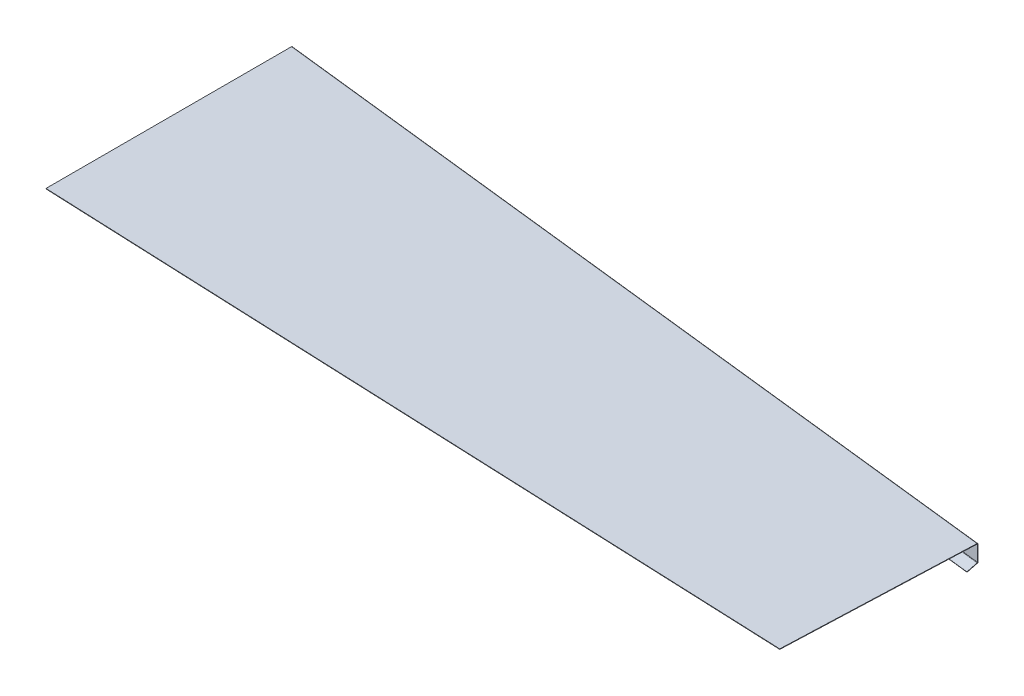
ISO-10303-21;
HEADER;
FILE_DESCRIPTION(('STEP AP214'),'2;1');
FILE_NAME('part.step','',(''),(''),'','','');
FILE_SCHEMA(('AUTOMOTIVE_DESIGN { 1 0 10303 214 1 1 1 1 }'));
ENDSEC;
DATA;
#1=APPLICATION_CONTEXT('core data for automotive mechanical design processes');
#2=APPLICATION_PROTOCOL_DEFINITION('international standard','automotive_design',2000,#1);
#3=PRODUCT_CONTEXT('',#1,'mechanical');
#4=PRODUCT('Part','Part','',(#3));
#5=PRODUCT_RELATED_PRODUCT_CATEGORY('part','',(#4));
#6=PRODUCT_DEFINITION_FORMATION('','',#4);
#7=PRODUCT_DEFINITION_CONTEXT('part definition',#1,'design');
#8=PRODUCT_DEFINITION('design','',#6,#7);
#9=PRODUCT_DEFINITION_SHAPE('','',#8);
#10=(LENGTH_UNIT() NAMED_UNIT(*) SI_UNIT(.MILLI.,.METRE.));
#11=(NAMED_UNIT(*) PLANE_ANGLE_UNIT() SI_UNIT($,.RADIAN.));
#12=(NAMED_UNIT(*) SI_UNIT($,.STERADIAN.) SOLID_ANGLE_UNIT());
#13=UNCERTAINTY_MEASURE_WITH_UNIT(LENGTH_MEASURE(1.E-05),#10,'distance_accuracy_value','');
#14=(GEOMETRIC_REPRESENTATION_CONTEXT(3) GLOBAL_UNCERTAINTY_ASSIGNED_CONTEXT((#13)) GLOBAL_UNIT_ASSIGNED_CONTEXT((#10,
#11,#12)) REPRESENTATION_CONTEXT('',''));
#15=CARTESIAN_POINT('',(0.,0.,0.));
#16=DIRECTION('',(0.,0.,1.));
#17=DIRECTION('',(1.,0.,0.));
#18=AXIS2_PLACEMENT_3D('',#15,#16,#17);
#19=CARTESIAN_POINT('',(119.2183013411,0.,-1155.85593612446));
#20=DIRECTION('',(0.993648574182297,0.,0.11252782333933));
#21=DIRECTION('',(0.,-1.,0.));
#22=AXIS2_PLACEMENT_3D('',#19,#20,#21);
#23=PLANE('',#22);
#24=DIRECTION('',(-0.11252782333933,0.,0.993648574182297));
#25=VECTOR('',#24,1.);
#26=CARTESIAN_POINT('',(119.2183013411,-54.7487291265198,-1155.85593612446));
#27=LINE('',#26,#25);
#28=CARTESIAN_POINT('',(119.40122657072,-54.7487291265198,-1157.47121124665));
#29=VERTEX_POINT('',#28);
#30=CARTESIAN_POINT('',(119.2183013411,-54.7487291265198,-1155.85593612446));
#31=VERTEX_POINT('',#30);
#32=EDGE_CURVE('E12',#29,#31,#27,.T.);
#33=ORIENTED_EDGE('',*,*,#32,.F.);
#34=DIRECTION('',(0.,1.,0.));
#35=VECTOR('',#34,1.);
#36=CARTESIAN_POINT('',(119.40122657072,0.,-1157.47121124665));
#37=LINE('',#36,#35);
#38=CARTESIAN_POINT('',(119.40122657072,-1.62560000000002,-1157.47121124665));
#39=VERTEX_POINT('',#38);
#40=EDGE_CURVE('E210',#39,#29,#37,.F.);
#41=ORIENTED_EDGE('',*,*,#40,.F.);
#42=DIRECTION('',(-0.11252782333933,0.,0.993648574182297));
#43=VECTOR('',#42,1.);
#44=CARTESIAN_POINT('',(119.2183013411,-1.62560000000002,-1155.85593612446));
#45=LINE('',#44,#43);
#46=CARTESIAN_POINT('',(119.2183013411,-1.62560000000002,-1155.85593612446));
#47=VERTEX_POINT('',#46);
#48=EDGE_CURVE('E158',#39,#47,#45,.T.);
#49=ORIENTED_EDGE('',*,*,#48,.T.);
#50=DIRECTION('',(0.,-1.,0.));
#51=VECTOR('',#50,1.);
#52=CARTESIAN_POINT('',(119.2183013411,0.,-1155.85593612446));
#53=LINE('',#52,#51);
#54=EDGE_CURVE('E213',#47,#31,#53,.T.);
#55=ORIENTED_EDGE('',*,*,#54,.T.);
#56=EDGE_LOOP('',(#33,#41,#49,#55));
#57=FACE_BOUND('',#56,.T.);
#58=ADVANCED_FACE('F145',(#57),#23,.T.);
#59=CARTESIAN_POINT('',(118.90753993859,-1.62560000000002,-1150.98315632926));
#60=CARTESIAN_POINT('',(118.96851501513,-1.62560000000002,-1151.52158136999));
#61=CARTESIAN_POINT('',(119.029490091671,-1.62560000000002,-1152.06000641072));
#62=CARTESIAN_POINT('',(119.090465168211,-1.62560000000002,-1152.59843145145));
#63=CARTESIAN_POINT('',(118.90753993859,-8.12800000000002,-1150.98315632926));
#64=CARTESIAN_POINT('',(118.96851501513,-7.04426666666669,-1151.52158136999));
#65=CARTESIAN_POINT('',(119.029490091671,-5.96053333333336,-1152.06000641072));
#66=CARTESIAN_POINT('',(119.090465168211,-4.87680000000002,-1152.59843145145));
#67=CARTESIAN_POINT('',(119.40122657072,-8.12800000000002,-1157.47121124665));
#68=CARTESIAN_POINT('',(119.34025149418,-7.04426666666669,-1156.93278620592));
#69=CARTESIAN_POINT('',(119.27927641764,-5.96053333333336,-1156.39436116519));
#70=CARTESIAN_POINT('',(119.2183013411,-4.87680000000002,-1155.85593612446));
#71=CARTESIAN_POINT('',(119.40122657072,-1.62560000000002,-1157.47121124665));
#72=CARTESIAN_POINT('',(119.34025149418,-1.62560000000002,-1156.93278620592));
#73=CARTESIAN_POINT('',(119.27927641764,-1.62560000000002,-1156.39436116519));
#74=CARTESIAN_POINT('',(119.2183013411,-1.62560000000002,-1155.85593612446));
#75=CARTESIAN_POINT('',(119.40122657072,4.87679999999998,-1157.47121124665));
#76=CARTESIAN_POINT('',(119.34025149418,3.79306666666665,-1156.93278620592));
#77=CARTESIAN_POINT('',(119.27927641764,2.70933333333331,-1156.39436116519));
#78=CARTESIAN_POINT('',(119.2183013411,1.62559999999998,-1155.85593612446));
#79=CARTESIAN_POINT('',(118.90753993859,4.87679999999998,-1150.98315632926));
#80=CARTESIAN_POINT('',(118.96851501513,3.79306666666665,-1151.52158136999));
#81=CARTESIAN_POINT('',(119.029490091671,2.70933333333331,-1152.06000641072));
#82=CARTESIAN_POINT('',(119.090465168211,1.62559999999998,-1152.59843145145));
#83=CARTESIAN_POINT('',(118.90753993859,-1.62560000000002,-1150.98315632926));
#84=CARTESIAN_POINT('',(118.96851501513,-1.62560000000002,-1151.52158136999));
#85=CARTESIAN_POINT('',(119.029490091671,-1.62560000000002,-1152.06000641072));
#86=CARTESIAN_POINT('',(119.090465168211,-1.62560000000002,-1152.59843145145));
#87=(BOUNDED_SURFACE() B_SPLINE_SURFACE(3,3,((#59,#60,#61,#62),(#63,#64,#65,#66),(#67,#68,#69,
#70),(#71,#72,#73,#74),(#75,#76,#77,#78),(#79,#80,#81,#82),(#83,#84,#85,#86)),.UNSPECIFIED.,.T.,
.F.,.F.) B_SPLINE_SURFACE_WITH_KNOTS((4,3,4),(4,4),(0.,0.5,1.),(0.,1.),
.UNSPECIFIED.) GEOMETRIC_REPRESENTATION_ITEM() RATIONAL_B_SPLINE_SURFACE(((1.,1.,1.,1.),
(0.333333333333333,0.333333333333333,0.333333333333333,0.333333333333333),(0.333333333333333,
0.333333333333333,0.333333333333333,0.333333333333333),(1.,1.,1.,1.),(0.333333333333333,
0.333333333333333,0.333333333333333,0.333333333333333),(0.333333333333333,0.333333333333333,
0.333333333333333,0.333333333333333),(1.,1.,1.,1.))) REPRESENTATION_ITEM('') SURFACE());
#88=CARTESIAN_POINT('',(119.154383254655,-1.62560000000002,-1154.22718378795));
#89=DIRECTION('',(-0.997117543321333,0.,-0.0758722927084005));
#90=DIRECTION('',(-0.0758722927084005,0.,0.997117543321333));
#91=AXIS2_PLACEMENT_3D('',#88,#89,#90);
#92=ELLIPSE('',#91,3.25340525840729,3.2512);
#93=CARTESIAN_POINT('',(119.154383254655,1.62559999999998,-1154.22718378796));
#94=VERTEX_POINT('',#93);
#95=EDGE_CURVE('E249',#39,#94,#92,.F.);
#96=DIRECTION('',(0.,-1.,0.));
#97=VECTOR('',#96,1.);
#98=CARTESIAN_POINT('',(119.154383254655,0.,-1154.22718378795));
#99=LINE('',#98,#97);
#100=CARTESIAN_POINT('',(119.154383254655,0.,-1154.22718378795));
#101=VERTEX_POINT('',#100);
#102=EDGE_CURVE('E288',#94,#101,#99,.T.);
#103=CARTESIAN_POINT('',(119.154383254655,-1.62560000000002,-1154.22718378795));
#104=DIRECTION('',(-0.999230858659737,0.,-0.0392134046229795));
#105=DIRECTION('',(-0.0392134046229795,0.,0.999230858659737));
#106=AXIS2_PLACEMENT_3D('',#103,#104,#105);
#107=ELLIPSE('',#106,1.6300060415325,1.6256);
#108=EDGE_CURVE('E308',#47,#101,#107,.F.);
#109=ORIENTED_EDGE('',*,*,#48,.F.);
#110=ORIENTED_EDGE('',*,*,#95,.T.);
#111=ORIENTED_EDGE('',*,*,#102,.T.);
#112=ORIENTED_EDGE('',*,*,#108,.F.);
#113=EDGE_LOOP('',(#109,#110,#111,#112));
#114=FACE_BOUND('',#113,.T.);
#115=ADVANCED_FACE('F309',(#114),#87,.T.);
#116=CARTESIAN_POINT('',(73.7447952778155,0.,2.89401039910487));
#117=DIRECTION('',(0.999230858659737,0.,0.0392134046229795));
#118=DIRECTION('',(0.0392134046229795,0.,-0.999230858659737));
#119=AXIS2_PLACEMENT_3D('',#116,#117,#118);
#120=PLANE('',#119);
#121=ORIENTED_EDGE('',*,*,#102,.F.);
#122=DIRECTION('',(0.0392134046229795,0.,-0.999230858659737));
#123=VECTOR('',#122,1.);
#124=CARTESIAN_POINT('',(73.7447952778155,1.62559999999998,2.89401039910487));
#125=LINE('',#124,#123);
#126=CARTESIAN_POINT('',(93.4092633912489,1.62559999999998,-498.193399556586));
#127=VERTEX_POINT('',#126);
#128=EDGE_CURVE('E357',#127,#94,#125,.T.);
#129=ORIENTED_EDGE('',*,*,#128,.F.);
#130=DIRECTION('',(0.,-1.,0.));
#131=VECTOR('',#130,1.);
#132=CARTESIAN_POINT('',(93.4092633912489,0.,-498.193399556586));
#133=LINE('',#132,#131);
#134=CARTESIAN_POINT('',(93.4092633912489,0.,-498.193399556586));
#135=VERTEX_POINT('',#134);
#136=EDGE_CURVE('E284',#127,#135,#133,.T.);
#137=ORIENTED_EDGE('',*,*,#136,.T.);
#138=DIRECTION('',(0.0392134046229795,0.,-0.999230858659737));
#139=VECTOR('',#138,1.);
#140=CARTESIAN_POINT('',(73.7447952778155,0.,2.89401039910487));
#141=LINE('',#140,#139);
#142=EDGE_CURVE('E389',#135,#101,#141,.T.);
#143=ORIENTED_EDGE('',*,*,#142,.T.);
#144=EDGE_LOOP('',(#121,#129,#137,#143));
#145=FACE_BOUND('',#144,.T.);
#146=ADVANCED_FACE('F388',(#145),#120,.T.);
#147=CARTESIAN_POINT('',(-2578.1,0.,-609.585406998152));
#148=DIRECTION('',(-0.041660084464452,0.,0.999131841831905));
#149=DIRECTION('',(0.999131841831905,0.,0.041660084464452));
#150=AXIS2_PLACEMENT_3D('',#147,#148,#149);
#151=PLANE('',#150);
#152=ORIENTED_EDGE('',*,*,#136,.F.);
#153=DIRECTION('',(0.999131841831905,0.,0.041660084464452));
#154=VECTOR('',#153,1.);
#155=CARTESIAN_POINT('',(-2578.1,1.62559999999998,-609.585406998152));
#156=LINE('',#155,#154);
#157=CARTESIAN_POINT('',(-2552.7,1.62559999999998,-608.526321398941));
#158=VERTEX_POINT('',#157);
#159=EDGE_CURVE('E363',#158,#127,#156,.T.);
#160=ORIENTED_EDGE('',*,*,#159,.F.);
#161=DIRECTION('',(0.,-1.,0.));
#162=VECTOR('',#161,1.);
#163=CARTESIAN_POINT('',(-2552.7,0.,-608.526321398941));
#164=LINE('',#163,#162);
#165=CARTESIAN_POINT('',(-2552.7,0.,-608.526321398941));
#166=VERTEX_POINT('',#165);
#167=EDGE_CURVE('E280',#158,#166,#164,.T.);
#168=ORIENTED_EDGE('',*,*,#167,.T.);
#169=DIRECTION('',(0.999131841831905,0.,0.041660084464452));
#170=VECTOR('',#169,1.);
#171=CARTESIAN_POINT('',(-2578.1,0.,-609.585406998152));
#172=LINE('',#171,#170);
#173=EDGE_CURVE('E386',#166,#135,#172,.T.);
#174=ORIENTED_EDGE('',*,*,#173,.T.);
#175=EDGE_LOOP('',(#152,#160,#168,#174));
#176=FACE_BOUND('',#175,.T.);
#177=ADVANCED_FACE('F382',(#176),#151,.T.);
#178=CARTESIAN_POINT('',(-2552.7,0.,0.));
#179=DIRECTION('',(1.,0.,0.));
#180=DIRECTION('',(0.,0.,-1.));
#181=AXIS2_PLACEMENT_3D('',#178,#179,#180);
#182=PLANE('',#181);
#183=ORIENTED_EDGE('',*,*,#167,.F.);
#184=DIRECTION('',(0.,0.,1.));
#185=VECTOR('',#184,1.);
#186=CARTESIAN_POINT('',(-2552.7,1.62559999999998,0.));
#187=LINE('',#186,#185);
#188=CARTESIAN_POINT('',(-2552.7,1.62559999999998,-1456.80695478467));
#189=VERTEX_POINT('',#188);
#190=EDGE_CURVE('E351',#158,#189,#187,.F.);
#191=ORIENTED_EDGE('',*,*,#190,.T.);
#192=DIRECTION('',(0.,-1.,0.));
#193=VECTOR('',#192,1.);
#194=CARTESIAN_POINT('',(-2552.7,0.,-1456.80695478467));
#195=LINE('',#194,#193);
#196=CARTESIAN_POINT('',(-2552.7,0.,-1456.80695478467));
#197=VERTEX_POINT('',#196);
#198=EDGE_CURVE('E166',#189,#197,#195,.T.);
#199=ORIENTED_EDGE('',*,*,#198,.T.);
#200=DIRECTION('',(0.,0.,-1.));
#201=VECTOR('',#200,1.);
#202=CARTESIAN_POINT('',(-2552.7,0.,0.));
#203=LINE('',#202,#201);
#204=EDGE_CURVE('E397',#166,#197,#203,.T.);
#205=ORIENTED_EDGE('',*,*,#204,.F.);
#206=EDGE_LOOP('',(#183,#191,#199,#205));
#207=FACE_BOUND('',#206,.T.);
#208=ADVANCED_FACE('F380',(#207),#182,.F.);
#209=CARTESIAN_POINT('',(-2552.88292522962,-1.62560000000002,-1453.5556887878));
#210=CARTESIAN_POINT('',(-2552.82195015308,-1.62560000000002,-1454.09411382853));
#211=CARTESIAN_POINT('',(-2552.76097507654,-1.62560000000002,-1454.63253886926));
#212=CARTESIAN_POINT('',(-2552.7,-1.62560000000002,-1455.17096390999));
#213=CARTESIAN_POINT('',(-2552.88292522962,4.87679999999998,-1453.5556887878));
#214=CARTESIAN_POINT('',(-2552.82195015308,3.79306666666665,-1454.09411382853));
#215=CARTESIAN_POINT('',(-2552.76097507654,2.70933333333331,-1454.63253886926));
#216=CARTESIAN_POINT('',(-2552.7,1.62559999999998,-1455.17096390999));
#217=CARTESIAN_POINT('',(-2552.51707477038,4.87679999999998,-1460.05822078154));
#218=CARTESIAN_POINT('',(-2552.57804984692,3.79306666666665,-1459.51979574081));
#219=CARTESIAN_POINT('',(-2552.63902492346,2.70933333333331,-1458.98137070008));
#220=CARTESIAN_POINT('',(-2552.7,1.62559999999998,-1458.44294565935));
#221=CARTESIAN_POINT('',(-2552.51707477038,-1.62560000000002,-1460.05822078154));
#222=CARTESIAN_POINT('',(-2552.57804984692,-1.62560000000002,-1459.51979574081));
#223=CARTESIAN_POINT('',(-2552.63902492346,-1.62560000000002,-1458.98137070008));
#224=CARTESIAN_POINT('',(-2552.7,-1.62560000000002,-1458.44294565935));
#225=CARTESIAN_POINT('',(-2552.51707477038,-8.12800000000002,-1460.05822078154));
#226=CARTESIAN_POINT('',(-2552.57804984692,-7.04426666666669,-1459.51979574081));
#227=CARTESIAN_POINT('',(-2552.63902492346,-5.96053333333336,-1458.98137070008));
#228=CARTESIAN_POINT('',(-2552.7,-4.87680000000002,-1458.44294565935));
#229=CARTESIAN_POINT('',(-2552.88292522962,-8.12800000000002,-1453.5556887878));
#230=CARTESIAN_POINT('',(-2552.82195015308,-7.04426666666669,-1454.09411382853));
#231=CARTESIAN_POINT('',(-2552.76097507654,-5.96053333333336,-1454.63253886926));
#232=CARTESIAN_POINT('',(-2552.7,-4.87680000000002,-1455.17096390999));
#233=CARTESIAN_POINT('',(-2552.88292522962,-1.62560000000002,-1453.5556887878));
#234=CARTESIAN_POINT('',(-2552.82195015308,-1.62560000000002,-1454.09411382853));
#235=CARTESIAN_POINT('',(-2552.76097507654,-1.62560000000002,-1454.63253886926));
#236=CARTESIAN_POINT('',(-2552.7,-1.62560000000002,-1455.17096390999));
#237=(BOUNDED_SURFACE() B_SPLINE_SURFACE(3,3,((#209,#210,#211,#212),(#213,#214,#215,#216),(#217,
#218,#219,#220),(#221,#222,#223,#224),(#225,#226,#227,#228),(#229,#230,#231,#232),(#233,#234,
#235,#236)),.UNSPECIFIED.,.T.,.F.,.F.) B_SPLINE_SURFACE_WITH_KNOTS((4,3,4),(4,4),(0.,0.5,1.),
(0.,1.),.UNSPECIFIED.) GEOMETRIC_REPRESENTATION_ITEM() RATIONAL_B_SPLINE_SURFACE(((1.,1.,1.,1.),
(0.333333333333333,0.333333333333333,0.333333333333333,0.333333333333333),(0.333333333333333,
0.333333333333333,0.333333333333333,0.333333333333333),(1.,1.,1.,1.),(0.333333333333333,
0.333333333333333,0.333333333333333,0.333333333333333),(0.333333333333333,0.333333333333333,
0.333333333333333,0.333333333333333),(1.,1.,1.,1.))) REPRESENTATION_ITEM('') SURFACE());
#238=CARTESIAN_POINT('',(-2552.7,-1.62560000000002,-1456.80695478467));
#239=DIRECTION('',(0.998420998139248,0.,0.0561739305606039));
#240=DIRECTION('',(-0.0561739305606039,0.,0.998420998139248));
#241=AXIS2_PLACEMENT_3D('',#238,#239,#240);
#242=ELLIPSE('',#241,3.25640787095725,3.2512);
#243=CARTESIAN_POINT('',(-2552.51707477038,-1.62560000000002,-1460.05822078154));
#244=VERTEX_POINT('',#243);
#245=EDGE_CURVE('E255',#189,#244,#242,.F.);
#246=DIRECTION('',(-0.11252782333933,0.,0.993648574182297));
#247=VECTOR('',#246,1.);
#248=CARTESIAN_POINT('',(-2552.7,-1.62560000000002,-1458.44294565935));
#249=LINE('',#248,#247);
#250=CARTESIAN_POINT('',(-2552.7,-1.62560000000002,-1458.44294565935));
#251=VERTEX_POINT('',#250);
#252=EDGE_CURVE('E274',#244,#251,#249,.T.);
#253=CARTESIAN_POINT('',(-2552.7,-1.62560000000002,-1456.80695478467));
#254=DIRECTION('',(1.,0.,0.));
#255=DIRECTION('',(0.,0.,1.));
#256=AXIS2_PLACEMENT_3D('',#253,#254,#255);
#257=ELLIPSE('',#256,1.63599087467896,1.6256);
#258=EDGE_CURVE('E315',#197,#251,#257,.F.);
#259=ORIENTED_EDGE('',*,*,#198,.F.);
#260=ORIENTED_EDGE('',*,*,#245,.T.);
#261=ORIENTED_EDGE('',*,*,#252,.T.);
#262=ORIENTED_EDGE('',*,*,#258,.F.);
#263=EDGE_LOOP('',(#259,#260,#261,#262));
#264=FACE_BOUND('',#263,.T.);
#265=ADVANCED_FACE('F454',(#264),#237,.T.);
#266=CARTESIAN_POINT('',(-2552.7,0.,-1458.44294565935));
#267=DIRECTION('',(0.993648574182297,0.,0.11252782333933));
#268=DIRECTION('',(0.,-1.,0.));
#269=AXIS2_PLACEMENT_3D('',#266,#267,#268);
#270=PLANE('',#269);
#271=ORIENTED_EDGE('',*,*,#252,.F.);
#272=DIRECTION('',(0.,1.,0.));
#273=VECTOR('',#272,1.);
#274=CARTESIAN_POINT('',(-2552.51707477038,0.,-1460.05822078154));
#275=LINE('',#274,#273);
#276=CARTESIAN_POINT('',(-2552.51707477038,-54.7487291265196,-1460.05822078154));
#277=VERTEX_POINT('',#276);
#278=EDGE_CURVE('E243',#244,#277,#275,.F.);
#279=ORIENTED_EDGE('',*,*,#278,.T.);
#280=DIRECTION('',(-0.112527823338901,0.,0.993648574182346));
#281=VECTOR('',#280,1.);
#282=CARTESIAN_POINT('',(-2552.7,-54.7487291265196,-1458.44294565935));
#283=LINE('',#282,#281);
#284=CARTESIAN_POINT('',(-2552.7,-54.7487291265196,-1458.44294565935));
#285=VERTEX_POINT('',#284);
#286=EDGE_CURVE('E270',#277,#285,#283,.T.);
#287=ORIENTED_EDGE('',*,*,#286,.T.);
#288=DIRECTION('',(0.,-1.,0.));
#289=VECTOR('',#288,1.);
#290=CARTESIAN_POINT('',(-2552.7,0.,-1458.44294565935));
#291=LINE('',#290,#289);
#292=EDGE_CURVE('E304',#251,#285,#291,.T.);
#293=ORIENTED_EDGE('',*,*,#292,.F.);
#294=EDGE_LOOP('',(#271,#279,#287,#293));
#295=FACE_BOUND('',#294,.T.);
#296=ADVANCED_FACE('F456',(#295),#270,.F.);
#297=CARTESIAN_POINT('',(-2552.7,-54.7487291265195,-1455.17096390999));
#298=CARTESIAN_POINT('',(-2552.76097507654,-54.7487291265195,-1454.63253886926));
#299=CARTESIAN_POINT('',(-2552.82195015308,-54.7487291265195,-1454.09411382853));
#300=CARTESIAN_POINT('',(-2552.88292522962,-54.7487291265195,-1453.5556887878));
#301=CARTESIAN_POINT('',(-2552.7,-51.4975291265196,-1455.17096390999));
#302=CARTESIAN_POINT('',(-2552.76097507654,-50.4137957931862,-1454.63253886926));
#303=CARTESIAN_POINT('',(-2552.82195015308,-49.3300624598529,-1454.09411382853));
#304=CARTESIAN_POINT('',(-2552.88292522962,-48.2463291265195,-1453.5556887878));
#305=CARTESIAN_POINT('',(-2552.7,-51.4975291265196,-1458.44294565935));
#306=CARTESIAN_POINT('',(-2552.63902492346,-50.4137957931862,-1458.98137070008));
#307=CARTESIAN_POINT('',(-2552.57804984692,-49.3300624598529,-1459.51979574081));
#308=CARTESIAN_POINT('',(-2552.51707477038,-48.2463291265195,-1460.05822078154));
#309=CARTESIAN_POINT('',(-2552.7,-54.7487291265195,-1458.44294565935));
#310=CARTESIAN_POINT('',(-2552.63902492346,-54.7487291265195,-1458.98137070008));
#311=CARTESIAN_POINT('',(-2552.57804984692,-54.7487291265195,-1459.51979574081));
#312=CARTESIAN_POINT('',(-2552.51707477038,-54.7487291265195,-1460.05822078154));
#313=CARTESIAN_POINT('',(-2552.7,-57.9999291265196,-1458.44294565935));
#314=CARTESIAN_POINT('',(-2552.63902492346,-59.0836624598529,-1458.98137070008));
#315=CARTESIAN_POINT('',(-2552.57804984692,-60.1673957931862,-1459.51979574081));
#316=CARTESIAN_POINT('',(-2552.51707477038,-61.2511291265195,-1460.05822078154));
#317=CARTESIAN_POINT('',(-2552.7,-57.9999291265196,-1455.17096390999));
#318=CARTESIAN_POINT('',(-2552.76097507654,-59.0836624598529,-1454.63253886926));
#319=CARTESIAN_POINT('',(-2552.82195015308,-60.1673957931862,-1454.09411382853));
#320=CARTESIAN_POINT('',(-2552.88292522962,-61.2511291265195,-1453.5556887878));
#321=CARTESIAN_POINT('',(-2552.7,-54.7487291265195,-1455.17096390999));
#322=CARTESIAN_POINT('',(-2552.76097507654,-54.7487291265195,-1454.63253886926));
#323=CARTESIAN_POINT('',(-2552.82195015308,-54.7487291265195,-1454.09411382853));
#324=CARTESIAN_POINT('',(-2552.88292522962,-54.7487291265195,-1453.5556887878));
#325=(BOUNDED_SURFACE() B_SPLINE_SURFACE(3,3,((#297,#298,#299,#300),(#301,#302,#303,#304),(#305,
#306,#307,#308),(#309,#310,#311,#312),(#313,#314,#315,#316),(#317,#318,#319,#320),(#321,#322,
#323,#324)),.UNSPECIFIED.,.T.,.F.,.F.) B_SPLINE_SURFACE_WITH_KNOTS((4,3,4),(4,4),(0.,0.5,1.),
(0.,1.),.UNSPECIFIED.) GEOMETRIC_REPRESENTATION_ITEM() RATIONAL_B_SPLINE_SURFACE(((1.,1.,1.,1.),
(0.333333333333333,0.333333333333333,0.333333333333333,0.333333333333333),(0.333333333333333,
0.333333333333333,0.333333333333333,0.333333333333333),(1.,1.,1.,1.),(0.333333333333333,
0.333333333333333,0.333333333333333,0.333333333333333),(0.333333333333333,0.333333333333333,
0.333333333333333,0.333333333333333),(1.,1.,1.,1.))) REPRESENTATION_ITEM('') SURFACE());
#326=CARTESIAN_POINT('',(-2552.7,-54.7487291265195,-1456.80695478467));
#327=DIRECTION('',(-0.998420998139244,0.,-0.0561739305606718));
#328=DIRECTION('',(-0.0561739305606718,0.,0.998420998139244));
#329=AXIS2_PLACEMENT_3D('',#326,#327,#328);
#330=ELLIPSE('',#329,3.25640787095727,3.2512);
#331=CARTESIAN_POINT('',(-2552.6462054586,-57.8561642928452,-1457.76308513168));
#332=VERTEX_POINT('',#331);
#333=EDGE_CURVE('E229',#277,#332,#330,.T.);
#334=DIRECTION('',(-0.0330921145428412,0.955780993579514,0.29221157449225));
#335=VECTOR('',#334,1.);
#336=CARTESIAN_POINT('',(-2552.7,-56.3024467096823,-1457.28806599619));
#337=LINE('',#336,#335);
#338=CARTESIAN_POINT('',(-2552.7,-56.3024467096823,-1457.28806599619));
#339=VERTEX_POINT('',#338);
#340=EDGE_CURVE('E266',#332,#339,#337,.T.);
#341=CARTESIAN_POINT('',(-2552.7,-54.7487291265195,-1456.80695478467));
#342=DIRECTION('',(-1.,0.,0.));
#343=DIRECTION('',(0.,0.,1.));
#344=AXIS2_PLACEMENT_3D('',#341,#342,#343);
#345=ELLIPSE('',#344,1.63599087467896,1.6256);
#346=EDGE_CURVE('E305',#285,#339,#345,.T.);
#347=ORIENTED_EDGE('',*,*,#286,.F.);
#348=ORIENTED_EDGE('',*,*,#333,.T.);
#349=ORIENTED_EDGE('',*,*,#340,.T.);
#350=ORIENTED_EDGE('',*,*,#346,.F.);
#351=EDGE_LOOP('',(#347,#348,#349,#350));
#352=FACE_BOUND('',#351,.T.);
#353=ADVANCED_FACE('F457',(#352),#325,.F.);
#354=CARTESIAN_POINT('',(-2552.7,-458.942217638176,-140.312716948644));
#355=DIRECTION('',(0.999452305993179,0.031646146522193,0.00967519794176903));
#356=DIRECTION('',(0.,0.292371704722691,-0.956304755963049));
#357=AXIS2_PLACEMENT_3D('',#354,#355,#356);
#358=PLANE('',#357);
#359=ORIENTED_EDGE('',*,*,#340,.F.);
#360=DIRECTION('',(0.,-0.292371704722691,0.956304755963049));
#361=VECTOR('',#360,1.);
#362=CARTESIAN_POINT('',(-2552.6462054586,-460.495935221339,-140.787736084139));
#363=LINE('',#362,#361);
#364=CARTESIAN_POINT('',(-2552.6462054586,-68.3267481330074,-1423.51534856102));
#365=VERTEX_POINT('',#364);
#366=EDGE_CURVE('E235',#365,#332,#363,.F.);
#367=ORIENTED_EDGE('',*,*,#366,.F.);
#368=DIRECTION('',(-0.0330921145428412,0.955780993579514,0.29221157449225));
#369=VECTOR('',#368,1.);
#370=CARTESIAN_POINT('',(-2552.7,-66.7730305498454,-1423.04032942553));
#371=LINE('',#370,#369);
#372=CARTESIAN_POINT('',(-2552.7,-66.7730305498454,-1423.04032942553));
#373=VERTEX_POINT('',#372);
#374=EDGE_CURVE('E262',#365,#373,#371,.T.);
#375=ORIENTED_EDGE('',*,*,#374,.T.);
#376=DIRECTION('',(0.,0.292371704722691,-0.956304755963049));
#377=VECTOR('',#376,1.);
#378=CARTESIAN_POINT('',(-2552.7,-458.942217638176,-140.312716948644));
#379=LINE('',#378,#377);
#380=EDGE_CURVE('E415',#373,#339,#379,.T.);
#381=ORIENTED_EDGE('',*,*,#380,.T.);
#382=EDGE_LOOP('',(#359,#367,#375,#381));
#383=FACE_BOUND('',#382,.T.);
#384=ADVANCED_FACE('F434',(#383),#358,.F.);
#385=CARTESIAN_POINT('',(143.10720616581,-66.7730305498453,-1117.74797060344));
#386=DIRECTION('',(0.107551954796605,0.294079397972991,-0.949710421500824));
#387=DIRECTION('',(-0.993648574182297,0.,-0.11252782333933));
#388=AXIS2_PLACEMENT_3D('',#385,#386,#387);
#389=PLANE('',#388);
#390=ORIENTED_EDGE('',*,*,#374,.F.);
#391=DIRECTION('',(-0.993648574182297,0.,-0.11252782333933));
#392=VECTOR('',#391,1.);
#393=CARTESIAN_POINT('',(143.161000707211,-68.3267481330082,-1118.22298973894));
#394=LINE('',#393,#392);
#395=CARTESIAN_POINT('',(117.888917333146,-68.3267481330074,-1121.08497999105));
#396=VERTEX_POINT('',#395);
#397=EDGE_CURVE('E347',#396,#365,#394,.T.);
#398=ORIENTED_EDGE('',*,*,#397,.F.);
#399=DIRECTION('',(-0.0330921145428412,0.955780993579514,0.29221157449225));
#400=VECTOR('',#399,1.);
#401=CARTESIAN_POINT('',(117.835122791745,-66.7730305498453,-1120.60996085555));
#402=LINE('',#401,#400);
#403=CARTESIAN_POINT('',(117.835122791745,-66.7730305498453,-1120.60996085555));
#404=VERTEX_POINT('',#403);
#405=EDGE_CURVE('E258',#396,#404,#402,.T.);
#406=ORIENTED_EDGE('',*,*,#405,.T.);
#407=DIRECTION('',(-0.993648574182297,0.,-0.11252782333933));
#408=VECTOR('',#407,1.);
#409=CARTESIAN_POINT('',(143.10720616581,-66.7730305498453,-1117.74797060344));
#410=LINE('',#409,#408);
#411=EDGE_CURVE('E405',#404,#373,#410,.T.);
#412=ORIENTED_EDGE('',*,*,#411,.T.);
#413=EDGE_LOOP('',(#390,#398,#406,#412));
#414=FACE_BOUND('',#413,.T.);
#415=ADVANCED_FACE('F460',(#414),#389,.F.);
#416=CARTESIAN_POINT('',(78.2733519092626,-376.352292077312,-112.502078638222));
#417=DIRECTION('',(0.998748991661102,0.0206573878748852,0.0455381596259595));
#418=DIRECTION('',(0.0374881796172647,0.29335296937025,-0.955268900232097));
#419=AXIS2_PLACEMENT_3D('',#416,#417,#418);
#420=PLANE('',#419);
#421=ORIENTED_EDGE('',*,*,#405,.F.);
#422=DIRECTION('',(0.0374881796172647,0.29335296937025,-0.955268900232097));
#423=VECTOR('',#422,1.);
#424=CARTESIAN_POINT('',(78.3271464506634,-377.906009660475,-112.977097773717));
#425=LINE('',#424,#423);
#426=CARTESIAN_POINT('',(119.226974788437,-57.8561642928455,-1155.18118543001));
#427=VERTEX_POINT('',#426);
#428=EDGE_CURVE('E344',#396,#427,#425,.T.);
#429=ORIENTED_EDGE('',*,*,#428,.T.);
#430=DIRECTION('',(-0.0330921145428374,0.95578099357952,0.292211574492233));
#431=VECTOR('',#430,1.);
#432=CARTESIAN_POINT('',(119.173180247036,-56.3024467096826,-1154.70616629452));
#433=LINE('',#432,#431);
#434=CARTESIAN_POINT('',(119.173180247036,-56.3024467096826,-1154.70616629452));
#435=VERTEX_POINT('',#434);
#436=EDGE_CURVE('E151',#427,#435,#433,.T.);
#437=ORIENTED_EDGE('',*,*,#436,.T.);
#438=DIRECTION('',(0.0374881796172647,0.29335296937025,-0.955268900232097));
#439=VECTOR('',#438,1.);
#440=CARTESIAN_POINT('',(78.2733519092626,-376.352292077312,-112.502078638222));
#441=LINE('',#440,#439);
#442=EDGE_CURVE('E409',#404,#435,#441,.T.);
#443=ORIENTED_EDGE('',*,*,#442,.F.);
#444=EDGE_LOOP('',(#421,#429,#437,#443));
#445=FACE_BOUND('',#444,.T.);
#446=ADVANCED_FACE('F444',(#445),#420,.T.);
#447=CARTESIAN_POINT('',(119.090465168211,-54.7487291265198,-1152.59843145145));
#448=CARTESIAN_POINT('',(119.029490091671,-54.7487291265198,-1152.06000641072));
#449=CARTESIAN_POINT('',(118.96851501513,-54.7487291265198,-1151.52158136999));
#450=CARTESIAN_POINT('',(118.90753993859,-54.7487291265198,-1150.98315632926));
#451=CARTESIAN_POINT('',(119.090465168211,-57.9999291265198,-1152.59843145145));
#452=CARTESIAN_POINT('',(119.029490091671,-59.0836624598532,-1152.06000641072));
#453=CARTESIAN_POINT('',(118.96851501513,-60.1673957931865,-1151.52158136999));
#454=CARTESIAN_POINT('',(118.90753993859,-61.2511291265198,-1150.98315632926));
#455=CARTESIAN_POINT('',(119.2183013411,-57.9999291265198,-1155.85593612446));
#456=CARTESIAN_POINT('',(119.27927641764,-59.0836624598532,-1156.39436116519));
#457=CARTESIAN_POINT('',(119.34025149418,-60.1673957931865,-1156.93278620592));
#458=CARTESIAN_POINT('',(119.40122657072,-61.2511291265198,-1157.47121124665));
#459=CARTESIAN_POINT('',(119.2183013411,-54.7487291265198,-1155.85593612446));
#460=CARTESIAN_POINT('',(119.27927641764,-54.7487291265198,-1156.39436116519));
#461=CARTESIAN_POINT('',(119.34025149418,-54.7487291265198,-1156.93278620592));
#462=CARTESIAN_POINT('',(119.40122657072,-54.7487291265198,-1157.47121124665));
#463=CARTESIAN_POINT('',(119.2183013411,-51.4975291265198,-1155.85593612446));
#464=CARTESIAN_POINT('',(119.27927641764,-50.4137957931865,-1156.39436116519));
#465=CARTESIAN_POINT('',(119.34025149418,-49.3300624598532,-1156.93278620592));
#466=CARTESIAN_POINT('',(119.40122657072,-48.2463291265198,-1157.47121124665));
#467=CARTESIAN_POINT('',(119.090465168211,-51.4975291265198,-1152.59843145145));
#468=CARTESIAN_POINT('',(119.029490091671,-50.4137957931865,-1152.06000641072));
#469=CARTESIAN_POINT('',(118.96851501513,-49.3300624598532,-1151.52158136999));
#470=CARTESIAN_POINT('',(118.90753993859,-48.2463291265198,-1150.98315632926));
#471=CARTESIAN_POINT('',(119.090465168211,-54.7487291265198,-1152.59843145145));
#472=CARTESIAN_POINT('',(119.029490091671,-54.7487291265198,-1152.06000641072));
#473=CARTESIAN_POINT('',(118.96851501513,-54.7487291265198,-1151.52158136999));
#474=CARTESIAN_POINT('',(118.90753993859,-54.7487291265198,-1150.98315632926));
#475=(BOUNDED_SURFACE() B_SPLINE_SURFACE(3,3,((#447,#448,#449,#450),(#451,#452,#453,#454),(#455,
#456,#457,#458),(#459,#460,#461,#462),(#463,#464,#465,#466),(#467,#468,#469,#470),(#471,#472,
#473,#474)),.UNSPECIFIED.,.T.,.F.,.F.) B_SPLINE_SURFACE_WITH_KNOTS((4,3,4),(4,4),(0.,0.5,1.),
(0.,1.),.UNSPECIFIED.) GEOMETRIC_REPRESENTATION_ITEM() RATIONAL_B_SPLINE_SURFACE(((1.,1.,1.,1.),
(0.333333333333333,0.333333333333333,0.333333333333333,0.333333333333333),(0.333333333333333,
0.333333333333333,0.333333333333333,0.333333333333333),(1.,1.,1.,1.),(0.333333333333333,
0.333333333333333,0.333333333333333,0.333333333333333),(0.333333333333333,0.333333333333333,
0.333333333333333,0.333333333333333),(1.,1.,1.,1.))) REPRESENTATION_ITEM('') SURFACE());
#476=CARTESIAN_POINT('',(119.154383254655,-54.7487291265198,-1154.22718378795));
#477=DIRECTION('',(0.997117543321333,0.,0.0758722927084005));
#478=DIRECTION('',(-0.0758722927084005,0.,0.997117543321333));
#479=AXIS2_PLACEMENT_3D('',#476,#477,#478);
#480=ELLIPSE('',#479,3.25340525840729,3.2512);
#481=EDGE_CURVE('E226',#427,#29,#480,.T.);
#482=CARTESIAN_POINT('',(119.154383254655,-54.7487291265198,-1154.22718378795));
#483=DIRECTION('',(0.999230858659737,0.,0.0392134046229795));
#484=DIRECTION('',(-0.0392134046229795,0.,0.999230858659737));
#485=AXIS2_PLACEMENT_3D('',#482,#483,#484);
#486=ELLIPSE('',#485,1.6300060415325,1.6256);
#487=EDGE_CURVE('E314',#435,#31,#486,.T.);
#488=ORIENTED_EDGE('',*,*,#481,.T.);
#489=ORIENTED_EDGE('',*,*,#32,.T.);
#490=ORIENTED_EDGE('',*,*,#487,.F.);
#491=ORIENTED_EDGE('',*,*,#436,.F.);
#492=EDGE_LOOP('',(#488,#489,#490,#491));
#493=FACE_BOUND('',#492,.T.);
#494=ADVANCED_FACE('F147',(#493),#475,.F.);
#495=CARTESIAN_POINT('',(13.0771766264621,-377.700761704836,-115.474711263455));
#496=DIRECTION('',(-0.0330921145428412,0.955780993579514,0.29221157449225));
#497=DIRECTION('',(0.,-0.292371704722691,0.956304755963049));
#498=AXIS2_PLACEMENT_3D('',#495,#496,#497);
#499=PLANE('',#498);
#500=ORIENTED_EDGE('',*,*,#442,.T.);
#501=DIRECTION('',(0.993648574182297,0.,0.11252782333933));
#502=VECTOR('',#501,1.);
#503=CARTESIAN_POINT('',(130.620320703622,-56.3024467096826,-1153.40981078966));
#504=LINE('',#503,#502);
#505=EDGE_CURVE('E323',#435,#339,#504,.F.);
#506=ORIENTED_EDGE('',*,*,#505,.T.);
#507=ORIENTED_EDGE('',*,*,#380,.F.);
#508=ORIENTED_EDGE('',*,*,#411,.F.);
#509=EDGE_LOOP('',(#500,#506,#507,#508));
#510=FACE_BOUND('',#509,.T.);
#511=ADVANCED_FACE('F439',(#510),#499,.T.);
#512=CARTESIAN_POINT('',(0.,0.,0.));
#513=DIRECTION('',(0.,1.,0.));
#514=DIRECTION('',(0.,0.,1.));
#515=AXIS2_PLACEMENT_3D('',#512,#513,#514);
#516=PLANE('',#515);
#517=ORIENTED_EDGE('',*,*,#204,.T.);
#518=DIRECTION('',(-0.993648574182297,0.,-0.11252782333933));
#519=VECTOR('',#518,1.);
#520=CARTESIAN_POINT('',(119.035376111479,0.,-1154.24066100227));
#521=LINE('',#520,#519);
#522=EDGE_CURVE('E322',#197,#101,#521,.F.);
#523=ORIENTED_EDGE('',*,*,#522,.T.);
#524=ORIENTED_EDGE('',*,*,#142,.F.);
#525=ORIENTED_EDGE('',*,*,#173,.F.);
#526=EDGE_LOOP('',(#517,#523,#524,#525));
#527=FACE_BOUND('',#526,.T.);
#528=ADVANCED_FACE('F392',(#527),#516,.F.);
#529=CARTESIAN_POINT('',(130.749451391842,0.,-1154.55006677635));
#530=DIRECTION('',(0.11252782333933,0.,-0.993648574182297));
#531=DIRECTION('',(-0.993648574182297,0.,-0.11252782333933));
#532=AXIS2_PLACEMENT_3D('',#529,#530,#531);
#533=PLANE('',#532);
#534=ORIENTED_EDGE('',*,*,#54,.F.);
#535=DIRECTION('',(-0.993648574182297,0.,-0.11252782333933));
#536=VECTOR('',#535,1.);
#537=CARTESIAN_POINT('',(-2552.7,-1.62560000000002,-1458.44294565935));
#538=LINE('',#537,#536);
#539=EDGE_CURVE('E300',#47,#251,#538,.T.);
#540=ORIENTED_EDGE('',*,*,#539,.T.);
#541=ORIENTED_EDGE('',*,*,#292,.T.);
#542=DIRECTION('',(0.993648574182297,0.,0.11252782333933));
#543=VECTOR('',#542,1.);
#544=CARTESIAN_POINT('',(130.749451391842,-54.7487291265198,-1154.55006677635));
#545=LINE('',#544,#543);
#546=EDGE_CURVE('E302',#285,#31,#545,.T.);
#547=ORIENTED_EDGE('',*,*,#546,.T.);
#548=EDGE_LOOP('',(#534,#540,#541,#547));
#549=FACE_BOUND('',#548,.T.);
#550=ADVANCED_FACE('F297',(#549),#533,.F.);
#551=CARTESIAN_POINT('',(130.566526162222,-54.7487291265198,-1152.93479165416));
#552=DIRECTION('',(0.993648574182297,0.,0.11252782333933));
#553=DIRECTION('',(0.11252782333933,0.,-0.993648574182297));
#554=AXIS2_PLACEMENT_3D('',#551,#552,#553);
#555=CYLINDRICAL_SURFACE('',#554,1.6256);
#556=ORIENTED_EDGE('',*,*,#346,.T.);
#557=ORIENTED_EDGE('',*,*,#505,.F.);
#558=ORIENTED_EDGE('',*,*,#487,.T.);
#559=ORIENTED_EDGE('',*,*,#546,.F.);
#560=EDGE_LOOP('',(#556,#557,#558,#559));
#561=FACE_BOUND('',#560,.T.);
#562=ADVANCED_FACE('F427',(#561),#555,.F.);
#563=CARTESIAN_POINT('',(130.566526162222,-1.62560000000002,-1152.93479165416));
#564=DIRECTION('',(0.993648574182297,0.,0.11252782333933));
#565=DIRECTION('',(0.11252782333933,0.,-0.993648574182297));
#566=AXIS2_PLACEMENT_3D('',#563,#564,#565);
#567=CYLINDRICAL_SURFACE('',#566,1.6256);
#568=ORIENTED_EDGE('',*,*,#108,.T.);
#569=ORIENTED_EDGE('',*,*,#522,.F.);
#570=ORIENTED_EDGE('',*,*,#258,.T.);
#571=ORIENTED_EDGE('',*,*,#539,.F.);
#572=EDGE_LOOP('',(#568,#569,#570,#571));
#573=FACE_BOUND('',#572,.T.);
#574=ADVANCED_FACE('F318',(#573),#567,.F.);
#575=CARTESIAN_POINT('',(13.130971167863,-379.254479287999,-115.94973039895));
#576=DIRECTION('',(-0.0330921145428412,0.955780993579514,0.29221157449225));
#577=DIRECTION('',(0.,-0.292371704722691,0.956304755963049));
#578=AXIS2_PLACEMENT_3D('',#575,#576,#577);
#579=PLANE('',#578);
#580=ORIENTED_EDGE('',*,*,#428,.F.);
#581=ORIENTED_EDGE('',*,*,#397,.T.);
#582=ORIENTED_EDGE('',*,*,#366,.T.);
#583=DIRECTION('',(0.993648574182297,0.,0.11252782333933));
#584=VECTOR('',#583,1.);
#585=CARTESIAN_POINT('',(130.674115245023,-57.8561642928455,-1153.88482992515));
#586=LINE('',#585,#584);
#587=EDGE_CURVE('E234',#427,#332,#586,.F.);
#588=ORIENTED_EDGE('',*,*,#587,.F.);
#589=EDGE_LOOP('',(#580,#581,#582,#588));
#590=FACE_BOUND('',#589,.T.);
#591=ADVANCED_FACE('F459',(#590),#579,.F.);
#592=CARTESIAN_POINT('',(0.,1.62559999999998,0.));
#593=DIRECTION('',(0.,1.,0.));
#594=DIRECTION('',(0.,0.,1.));
#595=AXIS2_PLACEMENT_3D('',#592,#593,#594);
#596=PLANE('',#595);
#597=ORIENTED_EDGE('',*,*,#190,.F.);
#598=ORIENTED_EDGE('',*,*,#159,.T.);
#599=ORIENTED_EDGE('',*,*,#128,.T.);
#600=DIRECTION('',(0.993648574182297,0.,0.11252782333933));
#601=VECTOR('',#600,1.);
#602=CARTESIAN_POINT('',(130.566526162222,1.62559999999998,-1152.93479165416));
#603=LINE('',#602,#601);
#604=EDGE_CURVE('E335',#189,#94,#603,.T.);
#605=ORIENTED_EDGE('',*,*,#604,.F.);
#606=EDGE_LOOP('',(#597,#598,#599,#605));
#607=FACE_BOUND('',#606,.T.);
#608=ADVANCED_FACE('F373',(#607),#596,.T.);
#609=CARTESIAN_POINT('',(130.932376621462,0.,-1156.16534189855));
#610=DIRECTION('',(0.11252782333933,0.,-0.993648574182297));
#611=DIRECTION('',(-0.993648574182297,0.,-0.11252782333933));
#612=AXIS2_PLACEMENT_3D('',#609,#610,#611);
#613=PLANE('',#612);
#614=ORIENTED_EDGE('',*,*,#40,.T.);
#615=DIRECTION('',(-0.993648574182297,0.,-0.11252782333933));
#616=VECTOR('',#615,1.);
#617=CARTESIAN_POINT('',(130.932376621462,-54.7487291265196,-1156.16534189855));
#618=LINE('',#617,#616);
#619=EDGE_CURVE('E223',#277,#29,#618,.F.);
#620=ORIENTED_EDGE('',*,*,#619,.F.);
#621=ORIENTED_EDGE('',*,*,#278,.F.);
#622=DIRECTION('',(-0.993648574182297,0.,-0.11252782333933));
#623=VECTOR('',#622,1.);
#624=CARTESIAN_POINT('',(130.932376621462,-1.62560000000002,-1156.16534189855));
#625=LINE('',#624,#623);
#626=EDGE_CURVE('E240',#39,#244,#625,.T.);
#627=ORIENTED_EDGE('',*,*,#626,.F.);
#628=EDGE_LOOP('',(#614,#620,#621,#627));
#629=FACE_BOUND('',#628,.T.);
#630=ADVANCED_FACE('F238',(#629),#613,.T.);
#631=CARTESIAN_POINT('',(130.566526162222,-54.7487291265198,-1152.93479165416));
#632=DIRECTION('',(0.993648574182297,0.,0.11252782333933));
#633=DIRECTION('',(0.11252782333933,0.,-0.993648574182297));
#634=AXIS2_PLACEMENT_3D('',#631,#632,#633);
#635=CYLINDRICAL_SURFACE('',#634,3.2512);
#636=ORIENTED_EDGE('',*,*,#333,.F.);
#637=ORIENTED_EDGE('',*,*,#619,.T.);
#638=ORIENTED_EDGE('',*,*,#481,.F.);
#639=ORIENTED_EDGE('',*,*,#587,.T.);
#640=EDGE_LOOP('',(#636,#637,#638,#639));
#641=FACE_BOUND('',#640,.T.);
#642=ADVANCED_FACE('F224',(#641),#635,.T.);
#643=CARTESIAN_POINT('',(130.566526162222,-1.62560000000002,-1152.93479165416));
#644=DIRECTION('',(0.993648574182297,0.,0.11252782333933));
#645=DIRECTION('',(0.11252782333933,0.,-0.993648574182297));
#646=AXIS2_PLACEMENT_3D('',#643,#644,#645);
#647=CYLINDRICAL_SURFACE('',#646,3.2512);
#648=ORIENTED_EDGE('',*,*,#95,.F.);
#649=ORIENTED_EDGE('',*,*,#626,.T.);
#650=ORIENTED_EDGE('',*,*,#245,.F.);
#651=ORIENTED_EDGE('',*,*,#604,.T.);
#652=EDGE_LOOP('',(#648,#649,#650,#651));
#653=FACE_BOUND('',#652,.T.);
#654=ADVANCED_FACE('F378',(#653),#647,.T.);
#655=CLOSED_SHELL('',(#58,#115,#146,#177,#208,#265,#296,#353,#384,#415,#446,#494,#511,#528,#550,
#562,#574,#591,#608,#630,#642,#654));
#656=MANIFOLD_SOLID_BREP('B2',#655);
#657=ADVANCED_BREP_SHAPE_REPRESENTATION('',(#18,#656),#14);
#658=SHAPE_DEFINITION_REPRESENTATION(#9,#657);
ENDSEC;
END-ISO-10303-21;
